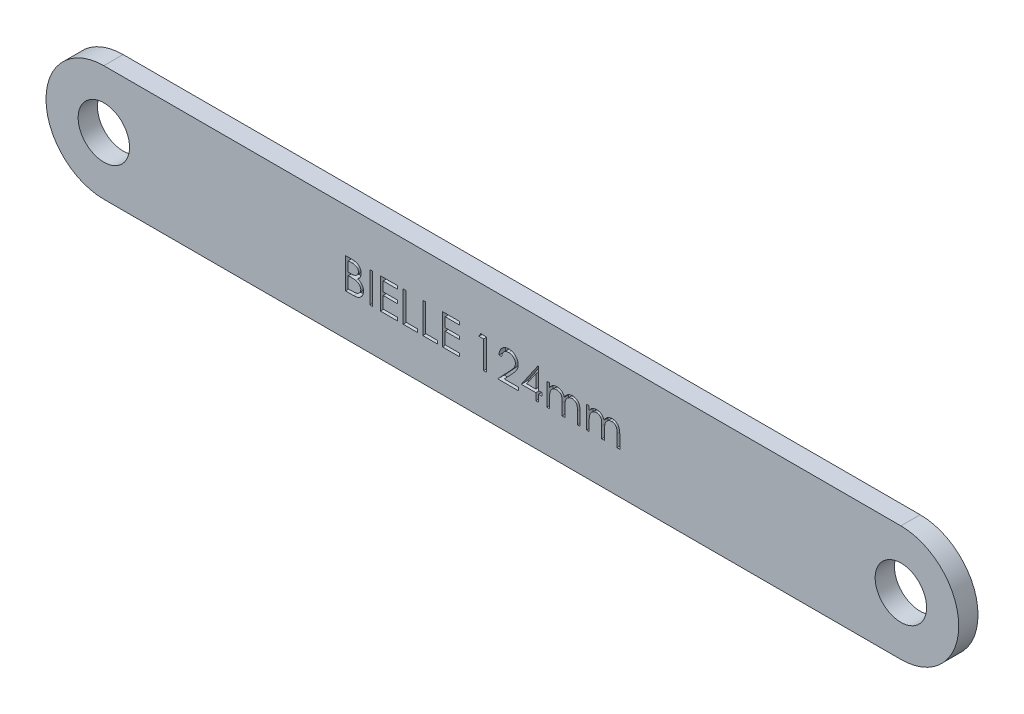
from build123d import *

# Parameters (mm, degrees)
ESQUISSE1_R           = 4
BOSS_EXTRU_1_DEPTH    = 3
ESQUISSE3_W           = 0.427403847
ESQUISSE3_H           = 4.7625
CUT_EXTRUDE_124_DEPTH = 1


with BuildPart() as part:
    # Esquisse1 → Boss.-Extru.1 (new body)
    with BuildSketch(Plane.XY):
        with BuildLine():
            Line((0, 9), (124, 9))
            ThreePointArc((124, 9), (133, 0), (124, -9))
            Line((124, -9), (0, -9))
            ThreePointArc((0, -9), (-9, 0), (0, 9))
        make_face()
        Circle(ESQUISSE1_R, mode=Mode.SUBTRACT)
        with Locations((124, 0)):
            Circle(ESQUISSE1_R, mode=Mode.SUBTRACT)
    extrude(amount=BOSS_EXTRU_1_DEPTH)

    # Esquisse3 → Cut-Extrude 124 (cut)
    # profile 1 of 11: a face of its own
    with BuildSketch(Plane.XY.offset(3)):
        with BuildLine():
            Line((37.591885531, 2.212824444), (38.521107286, 2.212824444))
            add(Edge.make_bspline(
                [(38.521107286, 2.212824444), (38.566593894, 2.212585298), (38.654758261, 2.212121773), (38.782964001, 2.204932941), (38.903045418, 2.195130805), (39.015037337, 2.179577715), (39.118888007, 2.160811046), (39.214910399, 2.138084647), (39.302799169, 2.110834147), (39.407727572, 2.067500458), (39.527362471, 2.003107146), (39.656900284, 1.907954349), (39.767668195, 1.791569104), (39.86317172, 1.660283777), (39.9391011, 1.515863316), (39.99403218, 1.36174992), (40.028809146, 1.199931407), (40.032385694, 1.088838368), (40.034193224, 1.032693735)],
                knots=[0, 0, 0, 0, 1.001505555, 1.941167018, 2.826882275, 3.653841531, 4.429895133, 5.150066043, 5.825578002, 6.45369114, 7.647487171, 8.808567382, 9.977351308, 11.170798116, 12.373658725, 13.556498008, 14.765093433, 16, 16, 16, 16], degree=3))
            add(Edge.make_bspline(
                [(40.034193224, 1.032693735), (40.032705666, 0.98009865), (40.029782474, 0.876744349), (40.001829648, 0.725577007), (39.958068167, 0.581679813), (39.897237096, 0.445577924), (39.81817688, 0.320346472), (39.724480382, 0.204975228), (39.61143659, 0.104348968), (39.526741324, 0.04809309), (39.483719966, 0.019517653)],
                knots=[0, 0, 0, 0, 1.044552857, 2.05264487, 3.044412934, 4.028983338, 5.005914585, 5.980388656, 6.974128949, 8, 8, 8, 8], degree=3))
            add(Edge.make_bspline(
                [(39.483719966, 0.019517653), (39.537822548, -0.001253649), (39.64133419, -0.040994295), (39.783781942, -0.111255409), (39.906511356, -0.187675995), (40.010466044, -0.271131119), (40.099371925, -0.361086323), (40.177004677, -0.458860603), (40.243246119, -0.565729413), (40.30000549, -0.680578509), (40.344295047, -0.802235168), (40.377463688, -0.92955826), (40.396469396, -1.062091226), (40.399174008, -1.152286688), (40.400539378, -1.197820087)],
                knots=[0, 0, 0, 0, 1.27268992, 2.434971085, 3.483601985, 4.442670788, 5.356604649, 6.2567628, 7.179492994, 8.113709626, 9.066344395, 10.018646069, 10.999752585, 12, 12, 12, 12], degree=3))
            add(Edge.make_bspline(
                [(40.400539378, -1.197820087), (40.399210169, -1.244311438), (40.396594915, -1.335784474), (40.377300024, -1.470161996), (40.34463049, -1.598579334), (40.299630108, -1.721867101), (40.24089853, -1.839786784), (40.169422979, -1.952471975), (40.084199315, -2.058790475), (39.988863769, -2.15992369), (39.881010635, -2.250857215), (39.764648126, -2.331841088), (39.638310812, -2.398442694), (39.504073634, -2.454389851), (39.360430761, -2.497126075), (39.208027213, -2.52702447), (39.046994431, -2.547169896), (38.936491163, -2.548826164), (38.879821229, -2.549675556)],
                knots=[0, 0, 0, 0, 0.978564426, 1.925352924, 2.850884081, 3.763762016, 4.682927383, 5.618979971, 6.567305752, 7.547517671, 8.540179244, 9.531824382, 10.526200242, 11.540722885, 12.589160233, 13.674978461, 14.80764778, 16, 16, 16, 16], degree=3))
            Line((38.879821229, -2.549675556), (37.591885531, -2.549675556))
            Line((37.591885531, -2.549675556), (37.591885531, 2.212824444))
        make_face()
        with BuildLine():
            Line((38.019289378, 1.724362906), (38.019289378, 0.197920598))
            Line((38.019289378, 0.197920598), (38.306451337, 0.197920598))
            add(Edge.make_bspline(
                [(38.306451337, 0.197920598), (38.348427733, 0.198464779), (38.429534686, 0.199516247), (38.546991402, 0.202528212), (38.656018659, 0.210961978), (38.75642826, 0.21939332), (38.848062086, 0.233101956), (38.930717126, 0.249419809), (39.005690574, 0.266677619), (39.092149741, 0.296027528), (39.190220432, 0.339403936), (39.294768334, 0.40672097), (39.386935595, 0.486900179), (39.464764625, 0.579416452), (39.528461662, 0.681287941), (39.572703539, 0.790889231), (39.602703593, 0.905488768), (39.605413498, 0.984162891), (39.606789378, 1.024107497)],
                knots=[0, 0, 0, 0, 1.156816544, 2.235205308, 3.236616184, 4.169592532, 5.011045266, 5.787822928, 6.49130361, 7.128639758, 8.301311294, 9.436451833, 10.541879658, 11.654887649, 12.756523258, 13.837046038, 14.901820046, 16, 16, 16, 16], degree=3))
            add(Edge.make_bspline(
                [(39.606789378, 1.024107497), (39.606073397, 1.050540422), (39.604668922, 1.10239149), (39.593166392, 1.17797829), (39.573616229, 1.24906711), (39.548505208, 1.316632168), (39.513414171, 1.378560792), (39.472098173, 1.436994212), (39.42217943, 1.489942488), (39.365359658, 1.539430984), (39.300033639, 1.583306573), (39.226240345, 1.621734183), (39.142981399, 1.652677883), (39.051659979, 1.679778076), (38.950870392, 1.698812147), (38.841775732, 1.714669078), (38.723482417, 1.722741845), (38.641642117, 1.7238105), (38.599337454, 1.724362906)],
                knots=[0, 0, 0, 0, 0.91205012, 1.789085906, 2.630437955, 3.453916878, 4.269457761, 5.079663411, 5.91843418, 6.774407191, 7.675494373, 8.627863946, 9.638891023, 10.736472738, 11.911756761, 13.175263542, 14.539845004, 16, 16, 16, 16], degree=3))
            Line((38.599337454, 1.724362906), (38.019289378, 1.724362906))
        make_face(mode=Mode.SUBTRACT)
        with BuildLine():
            Line((38.019289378, -0.29054094), (38.019289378, -2.061214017))
            Line((38.019289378, -2.061214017), (38.627958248, -2.061214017))
            add(Edge.make_bspline(
                [(38.627958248, -2.061214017), (38.671526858, -2.060691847), (38.755499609, -2.059685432), (38.876740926, -2.056399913), (38.989112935, -2.048926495), (39.092102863, -2.037161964), (39.1868228, -2.024400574), (39.27213646, -2.007240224), (39.348735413, -1.987579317), (39.437555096, -1.95718889), (39.53757237, -1.909976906), (39.645355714, -1.838792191), (39.741185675, -1.753987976), (39.822563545, -1.65583841), (39.889256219, -1.549115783), (39.937773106, -1.435978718), (39.967696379, -1.318296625), (39.971318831, -1.238059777), (39.973135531, -1.197820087)],
                knots=[0, 0, 0, 0, 1.160039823, 2.235823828, 3.228722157, 4.157150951, 4.99529583, 5.772374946, 6.472645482, 7.099169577, 8.269452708, 9.405989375, 10.527446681, 11.663510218, 12.788923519, 13.866172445, 14.929861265, 16, 16, 16, 16], degree=3))
            add(Edge.make_bspline(
                [(39.973135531, -1.197820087), (39.972759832, -1.172655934), (39.972014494, -1.122733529), (39.960774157, -1.049369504), (39.944426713, -0.978305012), (39.923292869, -0.909347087), (39.892514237, -0.843742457), (39.856582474, -0.780193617), (39.814452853, -0.718616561), (39.748806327, -0.64076703), (39.653322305, -0.551072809), (39.517649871, -0.463255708), (39.363382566, -0.392433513), (39.251494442, -0.36236244), (39.193695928, -0.346828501)],
                knots=[0, 0, 0, 0, 0.723448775, 1.435228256, 2.130040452, 2.821711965, 3.505591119, 4.210454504, 4.921174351, 5.648778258, 7.137944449, 8.670945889, 10.280296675, 12, 12, 12, 12], degree=3))
            add(Edge.make_bspline(
                [(39.193695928, -0.346828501), (39.170524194, -0.342127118), (39.120283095, -0.331933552), (39.03835778, -0.321173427), (38.944827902, -0.311587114), (38.839477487, -0.304496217), (38.722173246, -0.29716667), (38.592664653, -0.294316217), (38.451480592, -0.290915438), (38.353519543, -0.290668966), (38.302635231, -0.29054094)],
                knots=[0, 0, 0, 0, 0.634451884, 1.375622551, 2.216452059, 3.157844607, 4.20941857, 5.370758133, 6.634282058, 8, 8, 8, 8], degree=3))
            Line((38.302635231, -0.29054094), (38.019289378, -0.29054094))
        make_face(mode=Mode.SUBTRACT)
    # profile 2 of 11: a face of its own
    with BuildSketch(Plane.XY.offset(3)):
        with Locations((41.591164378, -0.168425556)):
            Rectangle(ESQUISSE3_W, ESQUISSE3_H)
    # profile 3 of 11: a face of its own
    with BuildSketch(Plane.XY.offset(3)):
        Polygon((43.026020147, 2.212824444), (45.712558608, 2.212824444), (45.712558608, 1.724362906), (43.453423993, 1.724362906), (43.453423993, 0.25897829), (45.712558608, 0.25897829), (45.712558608, -0.229483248), (43.453423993, -0.229483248), (43.453423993, -2.061214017), (45.712558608, -2.061214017), (45.712558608, -2.549675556), (43.026020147, -2.549675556), align=None)
    # profile 4 of 11: a face of its own
    with BuildSketch(Plane.XY.offset(3)):
        Polygon((46.567366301, 2.212824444), (46.994770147, 2.212824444), (46.994770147, -2.061214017), (48.826500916, -2.061214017), (48.826500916, -2.549675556), (46.567366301, -2.549675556), align=None)
    # profile 5 of 11: a face of its own
    with BuildSketch(Plane.XY.offset(3)):
        Polygon((49.620250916, 2.212824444), (50.047654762, 2.212824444), (50.047654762, -2.061214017), (51.879385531, -2.061214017), (51.879385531, -2.549675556), (49.620250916, -2.549675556), align=None)
    # profile 6 of 11: a face of its own
    with BuildSketch(Plane.XY.offset(3)):
        Polygon((52.673135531, 2.212824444), (55.359673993, 2.212824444), (55.359673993, 1.724362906), (53.100539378, 1.724362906), (53.100539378, 0.25897829), (55.359673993, 0.25897829), (55.359673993, -0.229483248), (53.100539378, -0.229483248), (53.100539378, -2.061214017), (55.359673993, -2.061214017), (55.359673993, -2.549675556), (52.673135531, -2.549675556), align=None)
    # profile 7 of 11: a face of its own
    with BuildSketch(Plane.XY.offset(3)):
        Polygon((58.631030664, 2.212824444), (59.51159707, 2.212824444), (59.51159707, -2.549675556), (59.084193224, -2.549675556), (59.084193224, 1.724362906), (58.351500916, 1.724362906), align=None)
    # profile 8 of 11: a face of its own
    with BuildSketch(Plane.XY.offset(3)):
        with BuildLine():
            Line((61.89284707, 0.747439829), (61.465443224, 0.747439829))
            add(Edge.make_bspline(
                [(61.465443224, 0.747439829), (61.468228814, 0.804142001), (61.473699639, 0.915503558), (61.499319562, 1.077869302), (61.535978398, 1.233065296), (61.587809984, 1.379845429), (61.652180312, 1.519507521), (61.72937367, 1.651496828), (61.820805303, 1.775309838), (61.924500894, 1.889798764), (62.037125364, 1.994828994), (62.158645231, 2.085527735), (62.286341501, 2.162159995), (62.419826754, 2.226224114), (62.560607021, 2.274311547), (62.707404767, 2.309991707), (62.860864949, 2.331458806), (62.965422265, 2.333766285), (63.018598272, 2.334939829)],
                knots=[0, 0, 0, 0, 1.10065271, 2.161652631, 3.183658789, 4.190468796, 5.17591951, 6.163126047, 7.15150782, 8.156236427, 9.156009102, 10.134482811, 11.092018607, 12.041330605, 13.001268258, 13.972401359, 14.968799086, 16, 16, 16, 16], degree=3))
            add(Edge.make_bspline(
                [(63.018598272, 2.334939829), (63.070819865, 2.333717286), (63.173433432, 2.331315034), (63.323196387, 2.310685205), (63.465768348, 2.278374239), (63.600870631, 2.233041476), (63.727425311, 2.172102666), (63.846383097, 2.098899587), (63.9591602, 2.014236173), (64.060678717, 1.914558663), (64.153898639, 1.808147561), (64.234319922, 1.694544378), (64.303189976, 1.577210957), (64.360595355, 1.455252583), (64.402853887, 1.327520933), (64.434937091, 1.195875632), (64.453071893, 1.058954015), (64.45585513, 0.966280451), (64.457270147, 0.919164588)],
                knots=[0, 0, 0, 0, 1.111607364, 2.184268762, 3.212621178, 4.221274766, 5.211760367, 6.196651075, 7.1921475, 8.207485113, 9.220403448, 10.201281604, 11.166441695, 12.114753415, 13.065576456, 14.026450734, 14.996634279, 16, 16, 16, 16], degree=3))
            add(Edge.make_bspline(
                [(64.457270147, 0.919164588), (64.454975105, 0.852830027), (64.450425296, 0.721324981), (64.411160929, 0.52782548), (64.350497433, 0.340176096), (64.27691949, 0.189165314), (64.202596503, 0.068093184), (64.137037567, -0.032484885), (64.058589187, -0.139745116), (63.967969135, -0.254767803), (63.866544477, -0.377904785), (63.753585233, -0.509206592), (63.62822849, -0.647278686), (63.540247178, -0.741584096), (63.494657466, -0.790450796)],
                knots=[0, 0, 0, 0, 1.184203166, 2.347625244, 3.513805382, 4.700623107, 5.337941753, 6.051866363, 6.845199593, 7.711357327, 8.668078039, 9.695487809, 10.805859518, 12, 12, 12, 12], degree=3))
            Line((63.494657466, -0.790450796), (62.30307844, -2.061214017))
            Line((62.30307844, -2.061214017), (64.518327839, -2.061214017))
            Line((64.518327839, -2.061214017), (64.518327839, -2.549675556))
            Line((64.518327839, -2.549675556), (61.282270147, -2.549675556))
            Line((61.282270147, -2.549675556), (63.129265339, -0.578656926))
            add(Edge.make_bspline(
                [(63.129265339, -0.578656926), (63.174234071, -0.531714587), (63.260609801, -0.441547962), (63.382778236, -0.309908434), (63.49250486, -0.187784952), (63.590499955, -0.075408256), (63.674637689, 0.028865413), (63.749303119, 0.121658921), (63.809127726, 0.207049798), (63.874054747, 0.30602899), (63.936938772, 0.426877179), (63.990975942, 0.57456052), (64.023925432, 0.726589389), (64.027878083, 0.82932609), (64.029866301, 0.881003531)],
                knots=[0, 0, 0, 0, 1.329631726, 2.553950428, 3.673215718, 4.687767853, 5.603093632, 6.413772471, 7.123043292, 7.734684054, 8.834405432, 9.900288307, 10.943827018, 12, 12, 12, 12], degree=3))
            add(Edge.make_bspline(
                [(64.029866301, 0.881003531), (64.029001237, 0.913499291), (64.027296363, 0.977542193), (64.012249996, 1.071439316), (63.989511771, 1.162015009), (63.956929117, 1.24954788), (63.913921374, 1.333157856), (63.861570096, 1.412946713), (63.801167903, 1.490084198), (63.731293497, 1.56241065), (63.654533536, 1.628651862), (63.573442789, 1.687331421), (63.487649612, 1.736370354), (63.397515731, 1.776570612), (63.303292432, 1.808105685), (63.204797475, 1.829956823), (63.10230301, 1.843676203), (63.032316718, 1.845532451), (62.996655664, 1.84647829)],
                knots=[0, 0, 0, 0, 0.991446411, 1.95395049, 2.89581595, 3.838931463, 4.798493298, 5.75982156, 6.748411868, 7.785213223, 8.824556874, 9.840280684, 10.836137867, 11.835679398, 12.848801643, 13.863922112, 14.911575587, 16, 16, 16, 16], degree=3))
            add(Edge.make_bspline(
                [(62.996655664, 1.84647829), (62.95941178, 1.845505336), (62.886270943, 1.843594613), (62.778884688, 1.830228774), (62.676442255, 1.807170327), (62.578685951, 1.775633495), (62.485450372, 1.735548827), (62.397188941, 1.685621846), (62.314099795, 1.626045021), (62.23602674, 1.558498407), (62.164093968, 1.483294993), (62.100893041, 1.399461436), (62.045669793, 1.308528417), (61.997487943, 1.210741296), (61.958359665, 1.10521276), (61.928460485, 0.992317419), (61.904801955, 0.872545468), (61.896898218, 0.789834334), (61.89284707, 0.747439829)],
                knots=[0, 0, 0, 0, 1.031018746, 2.02475058, 2.990194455, 3.934040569, 4.864654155, 5.795059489, 6.735614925, 7.690564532, 8.649604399, 9.611025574, 10.590972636, 11.591080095, 12.624614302, 13.701020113, 14.821632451, 16, 16, 16, 16], degree=3))
        make_face()
    # profile 9 of 11: a face of its own
    with BuildSketch(Plane.XY.offset(3)):
        Polygon((67.545453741, 2.334939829), (67.632270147, 2.334939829), (67.632270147, -0.962175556), (68.181789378, -0.962175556), (68.181789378, -1.450637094), (67.632270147, -1.450637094), (67.632270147, -2.549675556), (67.204866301, -2.549675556), (67.204866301, -1.450637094), (64.945731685, -1.450637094), align=None)
        Polygon((67.204866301, -0.962175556), (67.204866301, 1.104245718), (65.786228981, -0.962175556), align=None, mode=Mode.SUBTRACT)
    # profile 10 of 11: a face of its own
    with BuildSketch(Plane.XY.offset(3)):
        with BuildLine():
            Line((68.914481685, 0.930612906), (69.341885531, 0.930612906))
            Line((69.341885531, 0.930612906), (69.341885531, 0.325760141))
            add(Edge.make_bspline(
                [(69.341885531, 0.325760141), (69.380371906, 0.378675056), (69.45411549, 0.480065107), (69.575036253, 0.613674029), (69.695835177, 0.72705984), (69.782830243, 0.78658139), (69.824622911, 0.815175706)],
                knots=[0, 0, 0, 0, 1.134379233, 2.173579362, 3.122582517, 4, 4, 4, 4], degree=3))
            add(Edge.make_bspline(
                [(69.824622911, 0.815175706), (69.881588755, 0.842397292), (69.994525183, 0.896364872), (70.1733492, 0.95111125), (70.356330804, 0.984755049), (70.479894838, 0.989356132), (70.542050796, 0.991670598)],
                knots=[0, 0, 0, 0, 1.014936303, 2.012140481, 3.000054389, 4, 4, 4, 4], degree=3))
            add(Edge.make_bspline(
                [(70.542050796, 0.991670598), (70.584087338, 0.990248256), (70.667275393, 0.987433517), (70.790534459, 0.969118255), (70.910084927, 0.937459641), (71.025220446, 0.893362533), (71.133697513, 0.839959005), (71.233151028, 0.77729851), (71.322446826, 0.706953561), (71.401539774, 0.625747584), (71.472662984, 0.531400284), (71.538084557, 0.421367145), (71.598534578, 0.293177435), (71.632037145, 0.200150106), (71.649675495, 0.151173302)],
                knots=[0, 0, 0, 0, 1.009824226, 1.998387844, 2.986035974, 3.974953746, 4.955485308, 5.885931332, 6.793869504, 7.679848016, 8.601185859, 9.625726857, 10.749998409, 12, 12, 12, 12], degree=3))
            add(Edge.make_bspline(
                [(71.649675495, 0.151173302), (71.668332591, 0.184816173), (71.705047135, 0.251020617), (71.766695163, 0.344717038), (71.831285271, 0.43235628), (71.899367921, 0.514007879), (71.970702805, 0.589268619), (72.045625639, 0.658387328), (72.123709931, 0.721660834), (72.232284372, 0.795579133), (72.37354367, 0.874093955), (72.551644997, 0.942168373), (72.736906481, 0.98423639), (72.862660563, 0.989176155), (72.926162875, 0.991670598)],
                knots=[0, 0, 0, 0, 0.86119277, 1.694706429, 2.50939023, 3.298075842, 4.073795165, 4.829715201, 5.57930267, 6.321991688, 7.768977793, 9.186738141, 10.579381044, 12, 12, 12, 12], degree=3))
            add(Edge.make_bspline(
                [(72.926162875, 0.991670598), (72.984512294, 0.989470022), (73.098707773, 0.985163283), (73.264956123, 0.951344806), (73.419998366, 0.893272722), (73.56352253, 0.814033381), (73.693007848, 0.714457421), (73.805561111, 0.59598161), (73.900498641, 0.459443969), (73.962518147, 0.331003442), (74.004584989, 0.217607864), (74.030521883, 0.120988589), (74.053435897, 0.014646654), (74.072460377, -0.101545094), (74.086364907, -0.227997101), (74.096666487, -0.364502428), (74.103638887, -0.511167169), (74.104131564, -0.612357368), (74.104385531, -0.664519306)],
                knots=[0, 0, 0, 0, 1.209669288, 2.367440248, 3.500751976, 4.631527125, 5.755587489, 6.87532382, 8.007944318, 9.190864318, 9.82315674, 10.514484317, 11.263564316, 12.079023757, 12.955305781, 13.901327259, 14.918167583, 16, 16, 16, 16], degree=3))
            Line((74.104385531, -0.664519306), (74.104385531, -2.549675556))
            Line((74.104385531, -2.549675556), (73.676981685, -2.549675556))
            Line((73.676981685, -2.549675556), (73.676981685, -0.662611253))
            add(Edge.make_bspline(
                [(73.676981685, -0.662611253), (73.676875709, -0.618087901), (73.676672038, -0.532520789), (73.673006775, -0.409712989), (73.666100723, -0.29776926), (73.658025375, -0.19684224), (73.646807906, -0.106696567), (73.632321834, -0.027513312), (73.616976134, 0.04133041), (73.591481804, 0.117647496), (73.55073128, 0.201835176), (73.488658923, 0.292626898), (73.410458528, 0.371658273), (73.320161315, 0.440263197), (73.217361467, 0.49604383), (73.104061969, 0.535880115), (72.980966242, 0.560540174), (72.895754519, 0.562997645), (72.851748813, 0.564266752)],
                knots=[0, 0, 0, 0, 1.253487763, 2.409012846, 3.458416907, 4.410876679, 5.259312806, 6.014470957, 6.676830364, 7.243083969, 8.276244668, 9.299465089, 10.325150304, 11.392391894, 12.482080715, 13.603491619, 14.762376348, 16, 16, 16, 16], degree=3))
            add(Edge.make_bspline(
                [(72.851748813, 0.564266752), (72.797769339, 0.562339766), (72.691085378, 0.55853131), (72.53535777, 0.519650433), (72.385718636, 0.461030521), (72.246633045, 0.376077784), (72.118688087, 0.274284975), (72.008606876, 0.153249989), (71.917667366, 0.01632141), (71.856089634, -0.110424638), (71.817187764, -0.224274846), (71.791501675, -0.323739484), (71.771521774, -0.436789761), (71.752784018, -0.562666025), (71.740554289, -0.702234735), (71.729439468, -0.854850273), (71.724240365, -1.020971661), (71.723513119, -1.136124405), (71.723135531, -1.195912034)],
                knots=[0, 0, 0, 0, 1.090531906, 2.155305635, 3.229839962, 4.33261226, 5.44038871, 6.529323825, 7.629011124, 8.757537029, 9.370236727, 10.061839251, 10.834451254, 11.692844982, 12.636905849, 13.66920014, 14.789842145, 16, 16, 16, 16], degree=3))
            Line((71.723135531, -1.195912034), (71.723135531, -2.549675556))
            Line((71.723135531, -2.549675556), (71.295731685, -2.549675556))
            Line((71.295731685, -2.549675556), (71.295731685, -0.779956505))
            add(Edge.make_bspline(
                [(71.295731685, -0.779956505), (71.295623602, -0.730027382), (71.295415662, -0.633968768), (71.291773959, -0.49621866), (71.28485252, -0.370922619), (71.276850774, -0.25822627), (71.265338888, -0.158334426), (71.252262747, -0.070711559), (71.236820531, 0.004422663), (71.211252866, 0.086832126), (71.172180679, 0.177620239), (71.109331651, 0.274422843), (71.030944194, 0.359151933), (70.938999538, 0.431485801), (70.83557752, 0.491277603), (70.721300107, 0.534357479), (70.597196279, 0.559427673), (70.511637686, 0.562623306), (70.467636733, 0.564266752)],
                knots=[0, 0, 0, 0, 1.320475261, 2.540461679, 3.643808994, 4.639130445, 5.527981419, 6.302341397, 6.981980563, 7.553956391, 8.582137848, 9.585246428, 10.591171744, 11.620968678, 12.668337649, 13.738356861, 14.836885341, 16, 16, 16, 16], degree=3))
            add(Edge.make_bspline(
                [(70.467636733, 0.564266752), (70.415907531, 0.562184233), (70.312813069, 0.558033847), (70.161362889, 0.520676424), (70.015105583, 0.462160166), (69.876374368, 0.380980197), (69.748910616, 0.280424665), (69.637320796, 0.162158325), (69.543509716, 0.027653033), (69.481281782, -0.097756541), (69.441142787, -0.208754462), (69.414479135, -0.303121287), (69.391565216, -0.407896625), (69.374537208, -0.523403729), (69.358099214, -0.64889029), (69.350165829, -0.784981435), (69.342448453, -0.931560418), (69.342077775, -1.032760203), (69.341885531, -1.085244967)],
                knots=[0, 0, 0, 0, 1.098833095, 2.189935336, 3.297829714, 4.440610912, 5.596351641, 6.740013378, 7.886572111, 9.072425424, 9.705826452, 10.395263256, 11.156850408, 11.985370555, 12.878090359, 13.847760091, 14.883794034, 16, 16, 16, 16], degree=3))
            Line((69.341885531, -1.085244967), (69.341885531, -2.549675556))
            Line((69.341885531, -2.549675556), (68.914481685, -2.549675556))
            Line((68.914481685, -2.549675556), (68.914481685, 0.930612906))
        make_face()
    # profile 11 of 11: a face of its own
    with BuildSketch(Plane.XY.offset(3)):
        with BuildLine():
            Line((75.081308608, 0.930612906), (75.508712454, 0.930612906))
            Line((75.508712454, 0.930612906), (75.508712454, 0.325760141))
            add(Edge.make_bspline(
                [(75.508712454, 0.325760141), (75.547198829, 0.378675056), (75.620942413, 0.480065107), (75.741863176, 0.613674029), (75.8626621, 0.72705984), (75.949657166, 0.78658139), (75.991449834, 0.815175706)],
                knots=[0, 0, 0, 0, 1.134379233, 2.173579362, 3.122582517, 4, 4, 4, 4], degree=3))
            add(Edge.make_bspline(
                [(75.991449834, 0.815175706), (76.048415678, 0.842397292), (76.161352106, 0.896364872), (76.340176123, 0.95111125), (76.523157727, 0.984755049), (76.646721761, 0.989356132), (76.708877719, 0.991670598)],
                knots=[0, 0, 0, 0, 1.014936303, 2.012140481, 3.000054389, 4, 4, 4, 4], degree=3))
            add(Edge.make_bspline(
                [(76.708877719, 0.991670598), (76.750914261, 0.990248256), (76.834102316, 0.987433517), (76.957361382, 0.969118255), (77.07691185, 0.937459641), (77.192047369, 0.893362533), (77.300524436, 0.839959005), (77.399977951, 0.77729851), (77.489273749, 0.706953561), (77.568366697, 0.625747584), (77.639489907, 0.531400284), (77.70491148, 0.421367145), (77.765361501, 0.293177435), (77.798864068, 0.200150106), (77.816502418, 0.151173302)],
                knots=[0, 0, 0, 0, 1.009824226, 1.998387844, 2.986035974, 3.974953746, 4.955485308, 5.885931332, 6.793869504, 7.679848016, 8.601185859, 9.625726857, 10.749998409, 12, 12, 12, 12], degree=3))
            add(Edge.make_bspline(
                [(77.816502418, 0.151173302), (77.835159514, 0.184816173), (77.871874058, 0.251020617), (77.933522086, 0.344717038), (77.998112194, 0.43235628), (78.066194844, 0.514007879), (78.137529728, 0.589268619), (78.212452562, 0.658387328), (78.290536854, 0.721660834), (78.399111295, 0.795579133), (78.540370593, 0.874093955), (78.71847192, 0.942168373), (78.903733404, 0.98423639), (79.029487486, 0.989176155), (79.092989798, 0.991670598)],
                knots=[0, 0, 0, 0, 0.86119277, 1.694706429, 2.50939023, 3.298075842, 4.073795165, 4.829715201, 5.57930267, 6.321991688, 7.768977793, 9.186738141, 10.579381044, 12, 12, 12, 12], degree=3))
            add(Edge.make_bspline(
                [(79.092989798, 0.991670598), (79.151339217, 0.989470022), (79.265534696, 0.985163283), (79.431783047, 0.951344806), (79.586825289, 0.893272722), (79.730349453, 0.814033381), (79.859834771, 0.714457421), (79.972388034, 0.59598161), (80.067325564, 0.459443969), (80.12934507, 0.331003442), (80.171411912, 0.217607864), (80.197348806, 0.120988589), (80.22026282, 0.014646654), (80.2392873, -0.101545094), (80.25319183, -0.227997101), (80.26349341, -0.364502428), (80.27046581, -0.511167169), (80.270958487, -0.612357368), (80.271212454, -0.664519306)],
                knots=[0, 0, 0, 0, 1.209669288, 2.367440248, 3.500751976, 4.631527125, 5.755587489, 6.87532382, 8.007944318, 9.190864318, 9.82315674, 10.514484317, 11.263564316, 12.079023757, 12.955305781, 13.901327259, 14.918167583, 16, 16, 16, 16], degree=3))
            Line((80.271212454, -0.664519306), (80.271212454, -2.549675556))
            Line((80.271212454, -2.549675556), (79.843808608, -2.549675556))
            Line((79.843808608, -2.549675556), (79.843808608, -0.662611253))
            add(Edge.make_bspline(
                [(79.843808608, -0.662611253), (79.843702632, -0.618087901), (79.843498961, -0.532520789), (79.839833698, -0.409712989), (79.832927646, -0.29776926), (79.824852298, -0.19684224), (79.813634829, -0.106696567), (79.799148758, -0.027513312), (79.783803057, 0.04133041), (79.758308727, 0.117647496), (79.717558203, 0.201835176), (79.655485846, 0.292626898), (79.577285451, 0.371658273), (79.486988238, 0.440263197), (79.38418839, 0.49604383), (79.270888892, 0.535880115), (79.147793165, 0.560540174), (79.062581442, 0.562997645), (79.018575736, 0.564266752)],
                knots=[0, 0, 0, 0, 1.253487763, 2.409012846, 3.458416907, 4.410876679, 5.259312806, 6.014470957, 6.676830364, 7.243083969, 8.276244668, 9.299465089, 10.325150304, 11.392391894, 12.482080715, 13.603491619, 14.762376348, 16, 16, 16, 16], degree=3))
            add(Edge.make_bspline(
                [(79.018575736, 0.564266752), (78.964596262, 0.562339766), (78.857912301, 0.55853131), (78.702184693, 0.519650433), (78.552545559, 0.461030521), (78.413459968, 0.376077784), (78.28551501, 0.274284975), (78.175433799, 0.153249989), (78.084494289, 0.01632141), (78.022916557, -0.110424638), (77.984014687, -0.224274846), (77.958328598, -0.323739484), (77.938348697, -0.436789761), (77.919610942, -0.562666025), (77.907381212, -0.702234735), (77.896266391, -0.854850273), (77.891067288, -1.020971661), (77.890340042, -1.136124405), (77.889962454, -1.195912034)],
                knots=[0, 0, 0, 0, 1.090531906, 2.155305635, 3.229839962, 4.33261226, 5.44038871, 6.529323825, 7.629011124, 8.757537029, 9.370236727, 10.061839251, 10.834451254, 11.692844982, 12.636905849, 13.66920014, 14.789842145, 16, 16, 16, 16], degree=3))
            Line((77.889962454, -1.195912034), (77.889962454, -2.549675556))
            Line((77.889962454, -2.549675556), (77.462558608, -2.549675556))
            Line((77.462558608, -2.549675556), (77.462558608, -0.779956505))
            add(Edge.make_bspline(
                [(77.462558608, -0.779956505), (77.462450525, -0.730027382), (77.462242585, -0.633968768), (77.458600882, -0.49621866), (77.451679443, -0.370922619), (77.443677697, -0.25822627), (77.432165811, -0.158334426), (77.41908967, -0.070711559), (77.403647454, 0.004422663), (77.378079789, 0.086832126), (77.339007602, 0.177620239), (77.276158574, 0.274422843), (77.197771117, 0.359151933), (77.105826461, 0.431485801), (77.002404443, 0.491277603), (76.88812703, 0.534357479), (76.764023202, 0.559427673), (76.678464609, 0.562623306), (76.634463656, 0.564266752)],
                knots=[0, 0, 0, 0, 1.320475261, 2.540461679, 3.643808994, 4.639130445, 5.527981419, 6.302341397, 6.981980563, 7.553956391, 8.582137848, 9.585246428, 10.591171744, 11.620968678, 12.668337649, 13.738356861, 14.836885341, 16, 16, 16, 16], degree=3))
            add(Edge.make_bspline(
                [(76.634463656, 0.564266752), (76.582734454, 0.562184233), (76.479639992, 0.558033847), (76.328189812, 0.520676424), (76.181932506, 0.462160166), (76.043201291, 0.380980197), (75.915737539, 0.280424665), (75.804147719, 0.162158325), (75.710336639, 0.027653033), (75.648108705, -0.097756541), (75.60796971, -0.208754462), (75.581306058, -0.303121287), (75.558392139, -0.407896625), (75.541364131, -0.523403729), (75.524926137, -0.64889029), (75.516992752, -0.784981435), (75.509275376, -0.931560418), (75.508904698, -1.032760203), (75.508712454, -1.085244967)],
                knots=[0, 0, 0, 0, 1.098833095, 2.189935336, 3.297829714, 4.440610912, 5.596351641, 6.740013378, 7.886572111, 9.072425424, 9.705826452, 10.395263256, 11.156850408, 11.985370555, 12.878090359, 13.847760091, 14.883794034, 16, 16, 16, 16], degree=3))
            Line((75.508712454, -1.085244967), (75.508712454, -2.549675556))
            Line((75.508712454, -2.549675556), (75.081308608, -2.549675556))
            Line((75.081308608, -2.549675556), (75.081308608, 0.930612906))
        make_face()
    extrude(amount=-CUT_EXTRUDE_124_DEPTH, mode=Mode.SUBTRACT)


solid = part.part
